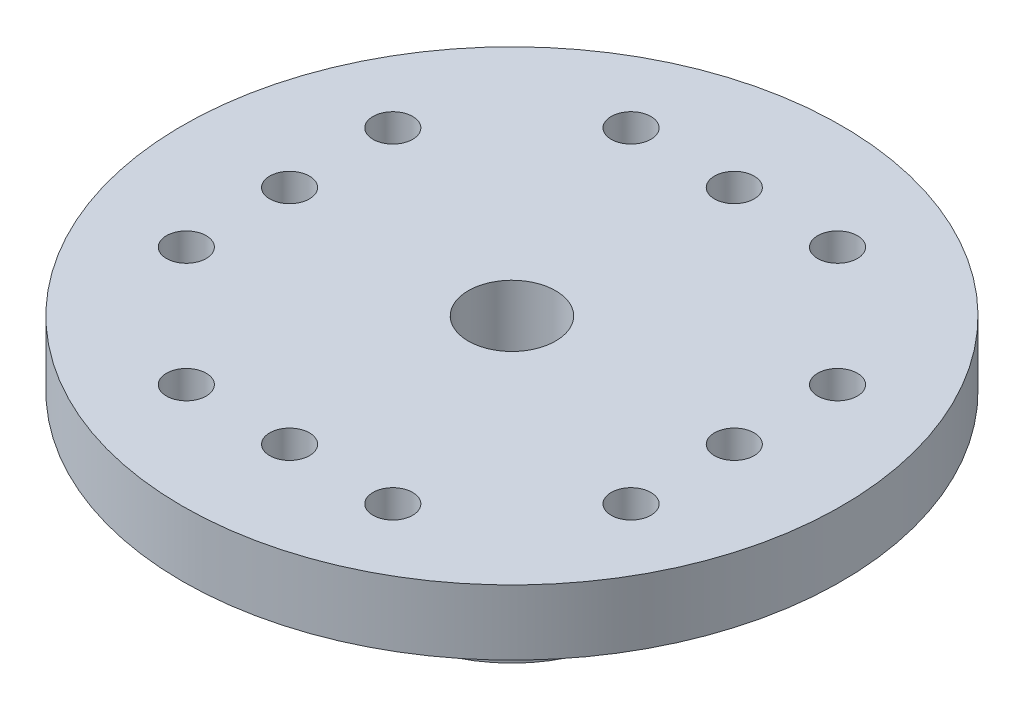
ISO-10303-21;
HEADER;
FILE_DESCRIPTION(('STEP AP214'),'2;1');
FILE_NAME('part.step','',(''),(''),'','','');
FILE_SCHEMA(('AUTOMOTIVE_DESIGN { 1 0 10303 214 1 1 1 1 }'));
ENDSEC;
DATA;
#1=APPLICATION_CONTEXT('core data for automotive mechanical design processes');
#2=APPLICATION_PROTOCOL_DEFINITION('international standard','automotive_design',2000,#1);
#3=PRODUCT_CONTEXT('',#1,'mechanical');
#4=PRODUCT('Part','Part','',(#3));
#5=PRODUCT_RELATED_PRODUCT_CATEGORY('part','',(#4));
#6=PRODUCT_DEFINITION_FORMATION('','',#4);
#7=PRODUCT_DEFINITION_CONTEXT('part definition',#1,'design');
#8=PRODUCT_DEFINITION('design','',#6,#7);
#9=PRODUCT_DEFINITION_SHAPE('','',#8);
#10=(LENGTH_UNIT() NAMED_UNIT(*) SI_UNIT(.MILLI.,.METRE.));
#11=(NAMED_UNIT(*) PLANE_ANGLE_UNIT() SI_UNIT($,.RADIAN.));
#12=(NAMED_UNIT(*) SI_UNIT($,.STERADIAN.) SOLID_ANGLE_UNIT());
#13=UNCERTAINTY_MEASURE_WITH_UNIT(LENGTH_MEASURE(1.E-05),#10,'distance_accuracy_value','');
#14=(GEOMETRIC_REPRESENTATION_CONTEXT(3) GLOBAL_UNCERTAINTY_ASSIGNED_CONTEXT((#13)) GLOBAL_UNIT_ASSIGNED_CONTEXT((#10,
#11,#12)) REPRESENTATION_CONTEXT('',''));
#15=CARTESIAN_POINT('',(0.,0.,0.));
#16=DIRECTION('',(0.,0.,1.));
#17=DIRECTION('',(1.,0.,0.));
#18=AXIS2_PLACEMENT_3D('',#15,#16,#17);
#19=CARTESIAN_POINT('',(0.,0.,0.));
#20=DIRECTION('',(0.,1.,0.));
#21=DIRECTION('',(0.,0.,1.));
#22=AXIS2_PLACEMENT_3D('',#19,#20,#21);
#23=PLANE('',#22);
#24=CARTESIAN_POINT('',(0.,0.,0.));
#25=DIRECTION('',(0.,1.,0.));
#26=DIRECTION('',(0.,0.,1.));
#27=AXIS2_PLACEMENT_3D('',#24,#25,#26);
#28=CIRCLE('',#27,3.8354);
#29=CARTESIAN_POINT('',(0.,0.,3.8354));
#30=VERTEX_POINT('',#29);
#31=EDGE_CURVE('E35',#30,#30,#28,.T.);
#32=ORIENTED_EDGE('',*,*,#31,.F.);
#33=EDGE_LOOP('',(#32));
#34=FACE_BOUND('',#33,.T.);
#35=CARTESIAN_POINT('',(0.,0.,0.));
#36=DIRECTION('',(0.,1.,0.));
#37=DIRECTION('',(0.,0.,1.));
#38=AXIS2_PLACEMENT_3D('',#35,#36,#37);
#39=CIRCLE('',#38,3.048);
#40=CARTESIAN_POINT('',(0.,0.,3.048));
#41=VERTEX_POINT('',#40);
#42=EDGE_CURVE('E42',#41,#41,#39,.T.);
#43=ORIENTED_EDGE('',*,*,#42,.T.);
#44=EDGE_LOOP('',(#43));
#45=FACE_BOUND('',#44,.T.);
#46=ADVANCED_FACE('F31',(#34,#45),#23,.F.);
#47=CARTESIAN_POINT('',(0.,4.826,0.));
#48=DIRECTION('',(0.,-1.,0.));
#49=DIRECTION('',(0.,0.,-1.));
#50=AXIS2_PLACEMENT_3D('',#47,#48,#49);
#51=CYLINDRICAL_SURFACE('',#50,3.8354);
#52=CARTESIAN_POINT('',(0.,4.826,0.));
#53=DIRECTION('',(0.,1.,0.));
#54=DIRECTION('',(0.,0.,1.));
#55=AXIS2_PLACEMENT_3D('',#52,#53,#54);
#56=CIRCLE('',#55,3.8354);
#57=CARTESIAN_POINT('',(0.,4.826,3.8354));
#58=VERTEX_POINT('',#57);
#59=EDGE_CURVE('E10',#58,#58,#56,.T.);
#60=ORIENTED_EDGE('',*,*,#59,.F.);
#61=EDGE_LOOP('',(#60));
#62=FACE_BOUND('',#61,.T.);
#63=ORIENTED_EDGE('',*,*,#31,.T.);
#64=EDGE_LOOP('',(#63));
#65=FACE_BOUND('',#64,.T.);
#66=ADVANCED_FACE('F33',(#62,#65),#51,.T.);
#67=CARTESIAN_POINT('',(0.,4.826,0.));
#68=DIRECTION('',(0.,-1.,0.));
#69=DIRECTION('',(0.,0.,-1.));
#70=AXIS2_PLACEMENT_3D('',#67,#68,#69);
#71=CYLINDRICAL_SURFACE('',#70,3.048);
#72=CARTESIAN_POINT('',(0.,4.826,0.));
#73=DIRECTION('',(0.,1.,0.));
#74=DIRECTION('',(0.,0.,1.));
#75=AXIS2_PLACEMENT_3D('',#72,#73,#74);
#76=CIRCLE('',#75,3.048);
#77=CARTESIAN_POINT('',(0.,4.826,3.048));
#78=VERTEX_POINT('',#77);
#79=EDGE_CURVE('E46',#78,#78,#76,.T.);
#80=ORIENTED_EDGE('',*,*,#79,.T.);
#81=EDGE_LOOP('',(#80));
#82=FACE_BOUND('',#81,.T.);
#83=ORIENTED_EDGE('',*,*,#42,.F.);
#84=EDGE_LOOP('',(#83));
#85=FACE_BOUND('',#84,.T.);
#86=ADVANCED_FACE('F187',(#82,#85),#71,.F.);
#87=CARTESIAN_POINT('',(0.,4.826,0.));
#88=DIRECTION('',(0.,1.,0.));
#89=DIRECTION('',(0.,0.,1.));
#90=AXIS2_PLACEMENT_3D('',#87,#88,#89);
#91=PLANE('',#90);
#92=CARTESIAN_POINT('',(0.,4.826,0.));
#93=DIRECTION('',(0.,1.,0.));
#94=DIRECTION('',(0.,0.,1.));
#95=AXIS2_PLACEMENT_3D('',#92,#93,#94);
#96=CIRCLE('',#95,1.397);
#97=CARTESIAN_POINT('',(0.,4.826,1.397));
#98=VERTEX_POINT('',#97);
#99=EDGE_CURVE('E53',#98,#98,#96,.T.);
#100=ORIENTED_EDGE('',*,*,#99,.T.);
#101=EDGE_LOOP('',(#100));
#102=FACE_BOUND('',#101,.T.);
#103=ORIENTED_EDGE('',*,*,#79,.F.);
#104=EDGE_LOOP('',(#103));
#105=FACE_BOUND('',#104,.T.);
#106=ADVANCED_FACE('F182',(#102,#105),#91,.F.);
#107=CARTESIAN_POINT('',(-1.95156391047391E-13,4.826,7.11199999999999));
#108=DIRECTION('',(0.,1.,0.));
#109=DIRECTION('',(0.,0.,1.));
#110=AXIS2_PLACEMENT_3D('',#107,#108,#109);
#111=CIRCLE('',#110,0.635000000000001);
#112=CARTESIAN_POINT('',(-1.95156391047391E-13,4.826,7.747));
#113=VERTEX_POINT('',#112);
#114=EDGE_CURVE('E125',#113,#113,#111,.T.);
#115=ORIENTED_EDGE('',*,*,#114,.T.);
#116=EDGE_LOOP('',(#115));
#117=FACE_BOUND('',#116,.T.);
#118=CARTESIAN_POINT('',(-3.30200000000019,4.826,7.11199999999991));
#119=DIRECTION('',(0.,1.,0.));
#120=DIRECTION('',(0.,0.,1.));
#121=AXIS2_PLACEMENT_3D('',#118,#119,#120);
#122=CIRCLE('',#121,0.635000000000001);
#123=CARTESIAN_POINT('',(-3.30200000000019,4.826,7.74699999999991));
#124=VERTEX_POINT('',#123);
#125=EDGE_CURVE('E119',#124,#124,#122,.T.);
#126=ORIENTED_EDGE('',*,*,#125,.T.);
#127=EDGE_LOOP('',(#126));
#128=FACE_BOUND('',#127,.T.);
#129=CARTESIAN_POINT('',(3.30199999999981,4.826,7.11200000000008));
#130=DIRECTION('',(0.,1.,0.));
#131=DIRECTION('',(0.,0.,1.));
#132=AXIS2_PLACEMENT_3D('',#129,#130,#131);
#133=CIRCLE('',#132,0.635000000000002);
#134=CARTESIAN_POINT('',(3.30199999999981,4.826,7.74700000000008));
#135=VERTEX_POINT('',#134);
#136=EDGE_CURVE('E113',#135,#135,#133,.T.);
#137=ORIENTED_EDGE('',*,*,#136,.T.);
#138=EDGE_LOOP('',(#137));
#139=FACE_BOUND('',#138,.T.);
#140=CARTESIAN_POINT('',(-3.30200000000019,4.826,-7.11199999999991));
#141=DIRECTION('',(0.,1.,0.));
#142=DIRECTION('',(0.,0.,-1.));
#143=AXIS2_PLACEMENT_3D('',#140,#141,#142);
#144=CIRCLE('',#143,0.635000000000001);
#145=CARTESIAN_POINT('',(-3.30200000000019,4.826,-7.74699999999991));
#146=VERTEX_POINT('',#145);
#147=EDGE_CURVE('E107',#146,#146,#144,.T.);
#148=ORIENTED_EDGE('',*,*,#147,.T.);
#149=EDGE_LOOP('',(#148));
#150=FACE_BOUND('',#149,.T.);
#151=CARTESIAN_POINT('',(-1.88217497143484E-13,4.826,-7.11199999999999));
#152=DIRECTION('',(0.,1.,0.));
#153=DIRECTION('',(0.,0.,-1.));
#154=AXIS2_PLACEMENT_3D('',#151,#152,#153);
#155=CIRCLE('',#154,0.635000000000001);
#156=CARTESIAN_POINT('',(-1.88217497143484E-13,4.826,-7.747));
#157=VERTEX_POINT('',#156);
#158=EDGE_CURVE('E101',#157,#157,#155,.T.);
#159=ORIENTED_EDGE('',*,*,#158,.T.);
#160=EDGE_LOOP('',(#159));
#161=FACE_BOUND('',#160,.T.);
#162=CARTESIAN_POINT('',(3.30199999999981,4.826,-7.11200000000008));
#163=DIRECTION('',(0.,1.,0.));
#164=DIRECTION('',(0.,0.,-1.));
#165=AXIS2_PLACEMENT_3D('',#162,#163,#164);
#166=CIRCLE('',#165,0.635000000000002);
#167=CARTESIAN_POINT('',(3.30199999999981,4.826,-7.74700000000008));
#168=VERTEX_POINT('',#167);
#169=EDGE_CURVE('E95',#168,#168,#166,.T.);
#170=ORIENTED_EDGE('',*,*,#169,.T.);
#171=EDGE_LOOP('',(#170));
#172=FACE_BOUND('',#171,.T.);
#173=CARTESIAN_POINT('',(7.112,4.826,-3.302));
#174=DIRECTION('',(0.,1.,0.));
#175=DIRECTION('',(0.,0.,-1.));
#176=AXIS2_PLACEMENT_3D('',#173,#174,#175);
#177=CIRCLE('',#176,0.635000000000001);
#178=CARTESIAN_POINT('',(7.112,4.826,-3.937));
#179=VERTEX_POINT('',#178);
#180=EDGE_CURVE('E89',#179,#179,#177,.T.);
#181=ORIENTED_EDGE('',*,*,#180,.T.);
#182=EDGE_LOOP('',(#181));
#183=FACE_BOUND('',#182,.T.);
#184=CARTESIAN_POINT('',(7.112,4.826,0.));
#185=DIRECTION('',(0.,1.,0.));
#186=DIRECTION('',(0.,0.,-1.));
#187=AXIS2_PLACEMENT_3D('',#184,#185,#186);
#188=CIRCLE('',#187,0.635000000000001);
#189=CARTESIAN_POINT('',(7.112,4.826,-0.635000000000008));
#190=VERTEX_POINT('',#189);
#191=EDGE_CURVE('E83',#190,#190,#188,.T.);
#192=ORIENTED_EDGE('',*,*,#191,.T.);
#193=EDGE_LOOP('',(#192));
#194=FACE_BOUND('',#193,.T.);
#195=CARTESIAN_POINT('',(7.112,4.826,3.30199999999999));
#196=DIRECTION('',(0.,1.,0.));
#197=DIRECTION('',(0.,0.,-1.));
#198=AXIS2_PLACEMENT_3D('',#195,#196,#197);
#199=CIRCLE('',#198,0.635000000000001);
#200=CARTESIAN_POINT('',(7.112,4.826,2.66699999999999));
#201=VERTEX_POINT('',#200);
#202=EDGE_CURVE('E77',#201,#201,#199,.T.);
#203=ORIENTED_EDGE('',*,*,#202,.T.);
#204=EDGE_LOOP('',(#203));
#205=FACE_BOUND('',#204,.T.);
#206=CARTESIAN_POINT('',(-7.112,4.826,3.302));
#207=DIRECTION('',(0.,1.,0.));
#208=DIRECTION('',(0.,0.,1.));
#209=AXIS2_PLACEMENT_3D('',#206,#207,#208);
#210=CIRCLE('',#209,0.635000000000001);
#211=CARTESIAN_POINT('',(-7.112,4.826,3.937));
#212=VERTEX_POINT('',#211);
#213=EDGE_CURVE('E71',#212,#212,#210,.T.);
#214=ORIENTED_EDGE('',*,*,#213,.T.);
#215=EDGE_LOOP('',(#214));
#216=FACE_BOUND('',#215,.T.);
#217=CARTESIAN_POINT('',(-7.112,4.826,-3.302));
#218=DIRECTION('',(0.,1.,0.));
#219=DIRECTION('',(0.,0.,1.));
#220=AXIS2_PLACEMENT_3D('',#217,#218,#219);
#221=CIRCLE('',#220,0.635000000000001);
#222=CARTESIAN_POINT('',(-7.112,4.826,-2.667));
#223=VERTEX_POINT('',#222);
#224=EDGE_CURVE('E65',#223,#223,#221,.T.);
#225=ORIENTED_EDGE('',*,*,#224,.T.);
#226=EDGE_LOOP('',(#225));
#227=FACE_BOUND('',#226,.T.);
#228=CARTESIAN_POINT('',(-7.112,4.826,0.));
#229=DIRECTION('',(0.,1.,0.));
#230=DIRECTION('',(0.,0.,1.));
#231=AXIS2_PLACEMENT_3D('',#228,#229,#230);
#232=CIRCLE('',#231,0.635000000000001);
#233=CARTESIAN_POINT('',(-7.112,4.826,0.635000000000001));
#234=VERTEX_POINT('',#233);
#235=EDGE_CURVE('E61',#234,#234,#232,.T.);
#236=ORIENTED_EDGE('',*,*,#235,.T.);
#237=EDGE_LOOP('',(#236));
#238=FACE_BOUND('',#237,.T.);
#239=CARTESIAN_POINT('',(0.,4.826,0.));
#240=DIRECTION('',(0.,1.,0.));
#241=DIRECTION('',(0.,0.,1.));
#242=AXIS2_PLACEMENT_3D('',#239,#240,#241);
#243=CIRCLE('',#242,10.541);
#244=CARTESIAN_POINT('',(0.,4.826,10.541));
#245=VERTEX_POINT('',#244);
#246=EDGE_CURVE('E50',#245,#245,#243,.T.);
#247=ORIENTED_EDGE('',*,*,#246,.F.);
#248=EDGE_LOOP('',(#247));
#249=FACE_BOUND('',#248,.T.);
#250=ORIENTED_EDGE('',*,*,#59,.T.);
#251=EDGE_LOOP('',(#250));
#252=FACE_BOUND('',#251,.T.);
#253=ADVANCED_FACE('F134',(#117,#128,#139,#150,#161,#172,#183,#194,#205,#216,#227,#238,#249,
#252),#91,.F.);
#254=CARTESIAN_POINT('',(0.,6.9088,0.));
#255=DIRECTION('',(0.,-1.,0.));
#256=DIRECTION('',(0.,0.,-1.));
#257=AXIS2_PLACEMENT_3D('',#254,#255,#256);
#258=CYLINDRICAL_SURFACE('',#257,10.541);
#259=CARTESIAN_POINT('',(0.,6.9088,0.));
#260=DIRECTION('',(0.,1.,0.));
#261=DIRECTION('',(0.,0.,1.));
#262=AXIS2_PLACEMENT_3D('',#259,#260,#261);
#263=CIRCLE('',#262,10.541);
#264=CARTESIAN_POINT('',(0.,6.9088,10.541));
#265=VERTEX_POINT('',#264);
#266=EDGE_CURVE('E49',#265,#265,#263,.T.);
#267=ORIENTED_EDGE('',*,*,#266,.F.);
#268=EDGE_LOOP('',(#267));
#269=FACE_BOUND('',#268,.T.);
#270=ORIENTED_EDGE('',*,*,#246,.T.);
#271=EDGE_LOOP('',(#270));
#272=FACE_BOUND('',#271,.T.);
#273=ADVANCED_FACE('F148',(#269,#272),#258,.T.);
#274=CARTESIAN_POINT('',(0.,6.9088,0.));
#275=DIRECTION('',(0.,1.,0.));
#276=DIRECTION('',(0.,0.,1.));
#277=AXIS2_PLACEMENT_3D('',#274,#275,#276);
#278=PLANE('',#277);
#279=CARTESIAN_POINT('',(-1.95156391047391E-13,6.9088,7.11199999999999));
#280=DIRECTION('',(0.,1.,0.));
#281=DIRECTION('',(0.,0.,1.));
#282=AXIS2_PLACEMENT_3D('',#279,#280,#281);
#283=CIRCLE('',#282,0.635000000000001);
#284=CARTESIAN_POINT('',(-1.95156391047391E-13,6.9088,7.747));
#285=VERTEX_POINT('',#284);
#286=EDGE_CURVE('E128',#285,#285,#283,.T.);
#287=ORIENTED_EDGE('',*,*,#286,.F.);
#288=EDGE_LOOP('',(#287));
#289=FACE_BOUND('',#288,.T.);
#290=CARTESIAN_POINT('',(-3.30200000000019,6.9088,7.11199999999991));
#291=DIRECTION('',(0.,1.,0.));
#292=DIRECTION('',(0.,0.,1.));
#293=AXIS2_PLACEMENT_3D('',#290,#291,#292);
#294=CIRCLE('',#293,0.635000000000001);
#295=CARTESIAN_POINT('',(-3.30200000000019,6.9088,7.74699999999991));
#296=VERTEX_POINT('',#295);
#297=EDGE_CURVE('E122',#296,#296,#294,.T.);
#298=ORIENTED_EDGE('',*,*,#297,.F.);
#299=EDGE_LOOP('',(#298));
#300=FACE_BOUND('',#299,.T.);
#301=CARTESIAN_POINT('',(3.30199999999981,6.9088,7.11200000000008));
#302=DIRECTION('',(0.,1.,0.));
#303=DIRECTION('',(0.,0.,1.));
#304=AXIS2_PLACEMENT_3D('',#301,#302,#303);
#305=CIRCLE('',#304,0.635000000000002);
#306=CARTESIAN_POINT('',(3.30199999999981,6.9088,7.74700000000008));
#307=VERTEX_POINT('',#306);
#308=EDGE_CURVE('E116',#307,#307,#305,.T.);
#309=ORIENTED_EDGE('',*,*,#308,.F.);
#310=EDGE_LOOP('',(#309));
#311=FACE_BOUND('',#310,.T.);
#312=CARTESIAN_POINT('',(-3.30200000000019,6.9088,-7.11199999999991));
#313=DIRECTION('',(0.,1.,0.));
#314=DIRECTION('',(0.,0.,-1.));
#315=AXIS2_PLACEMENT_3D('',#312,#313,#314);
#316=CIRCLE('',#315,0.635000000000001);
#317=CARTESIAN_POINT('',(-3.30200000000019,6.9088,-7.74699999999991));
#318=VERTEX_POINT('',#317);
#319=EDGE_CURVE('E110',#318,#318,#316,.T.);
#320=ORIENTED_EDGE('',*,*,#319,.F.);
#321=EDGE_LOOP('',(#320));
#322=FACE_BOUND('',#321,.T.);
#323=CARTESIAN_POINT('',(-1.88217497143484E-13,6.9088,-7.11199999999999));
#324=DIRECTION('',(0.,1.,0.));
#325=DIRECTION('',(0.,0.,-1.));
#326=AXIS2_PLACEMENT_3D('',#323,#324,#325);
#327=CIRCLE('',#326,0.635000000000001);
#328=CARTESIAN_POINT('',(-1.88217497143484E-13,6.9088,-7.747));
#329=VERTEX_POINT('',#328);
#330=EDGE_CURVE('E104',#329,#329,#327,.T.);
#331=ORIENTED_EDGE('',*,*,#330,.F.);
#332=EDGE_LOOP('',(#331));
#333=FACE_BOUND('',#332,.T.);
#334=CARTESIAN_POINT('',(3.30199999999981,6.9088,-7.11200000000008));
#335=DIRECTION('',(0.,1.,0.));
#336=DIRECTION('',(0.,0.,-1.));
#337=AXIS2_PLACEMENT_3D('',#334,#335,#336);
#338=CIRCLE('',#337,0.635000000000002);
#339=CARTESIAN_POINT('',(3.30199999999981,6.9088,-7.74700000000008));
#340=VERTEX_POINT('',#339);
#341=EDGE_CURVE('E98',#340,#340,#338,.T.);
#342=ORIENTED_EDGE('',*,*,#341,.F.);
#343=EDGE_LOOP('',(#342));
#344=FACE_BOUND('',#343,.T.);
#345=CARTESIAN_POINT('',(7.112,6.9088,-3.302));
#346=DIRECTION('',(0.,1.,0.));
#347=DIRECTION('',(0.,0.,-1.));
#348=AXIS2_PLACEMENT_3D('',#345,#346,#347);
#349=CIRCLE('',#348,0.635000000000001);
#350=CARTESIAN_POINT('',(7.112,6.9088,-3.937));
#351=VERTEX_POINT('',#350);
#352=EDGE_CURVE('E92',#351,#351,#349,.T.);
#353=ORIENTED_EDGE('',*,*,#352,.F.);
#354=EDGE_LOOP('',(#353));
#355=FACE_BOUND('',#354,.T.);
#356=CARTESIAN_POINT('',(7.112,6.9088,0.));
#357=DIRECTION('',(0.,1.,0.));
#358=DIRECTION('',(0.,0.,-1.));
#359=AXIS2_PLACEMENT_3D('',#356,#357,#358);
#360=CIRCLE('',#359,0.635000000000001);
#361=CARTESIAN_POINT('',(7.112,6.9088,-0.635000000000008));
#362=VERTEX_POINT('',#361);
#363=EDGE_CURVE('E86',#362,#362,#360,.T.);
#364=ORIENTED_EDGE('',*,*,#363,.F.);
#365=EDGE_LOOP('',(#364));
#366=FACE_BOUND('',#365,.T.);
#367=CARTESIAN_POINT('',(7.112,6.9088,3.30199999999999));
#368=DIRECTION('',(0.,1.,0.));
#369=DIRECTION('',(0.,0.,-1.));
#370=AXIS2_PLACEMENT_3D('',#367,#368,#369);
#371=CIRCLE('',#370,0.635000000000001);
#372=CARTESIAN_POINT('',(7.112,6.9088,2.66699999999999));
#373=VERTEX_POINT('',#372);
#374=EDGE_CURVE('E80',#373,#373,#371,.T.);
#375=ORIENTED_EDGE('',*,*,#374,.F.);
#376=EDGE_LOOP('',(#375));
#377=FACE_BOUND('',#376,.T.);
#378=CARTESIAN_POINT('',(-7.112,6.9088,3.302));
#379=DIRECTION('',(0.,1.,0.));
#380=DIRECTION('',(0.,0.,1.));
#381=AXIS2_PLACEMENT_3D('',#378,#379,#380);
#382=CIRCLE('',#381,0.635000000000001);
#383=CARTESIAN_POINT('',(-7.112,6.9088,3.937));
#384=VERTEX_POINT('',#383);
#385=EDGE_CURVE('E74',#384,#384,#382,.T.);
#386=ORIENTED_EDGE('',*,*,#385,.F.);
#387=EDGE_LOOP('',(#386));
#388=FACE_BOUND('',#387,.T.);
#389=CARTESIAN_POINT('',(-7.112,6.9088,-3.302));
#390=DIRECTION('',(0.,1.,0.));
#391=DIRECTION('',(0.,0.,1.));
#392=AXIS2_PLACEMENT_3D('',#389,#390,#391);
#393=CIRCLE('',#392,0.635000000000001);
#394=CARTESIAN_POINT('',(-7.112,6.9088,-2.667));
#395=VERTEX_POINT('',#394);
#396=EDGE_CURVE('E68',#395,#395,#393,.T.);
#397=ORIENTED_EDGE('',*,*,#396,.F.);
#398=EDGE_LOOP('',(#397));
#399=FACE_BOUND('',#398,.T.);
#400=CARTESIAN_POINT('',(-7.112,6.9088,0.));
#401=DIRECTION('',(0.,1.,0.));
#402=DIRECTION('',(0.,0.,1.));
#403=AXIS2_PLACEMENT_3D('',#400,#401,#402);
#404=CIRCLE('',#403,0.635000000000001);
#405=CARTESIAN_POINT('',(-7.112,6.9088,0.635000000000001));
#406=VERTEX_POINT('',#405);
#407=EDGE_CURVE('E62',#406,#406,#404,.T.);
#408=ORIENTED_EDGE('',*,*,#407,.F.);
#409=EDGE_LOOP('',(#408));
#410=FACE_BOUND('',#409,.T.);
#411=CARTESIAN_POINT('',(0.,6.9088,0.));
#412=DIRECTION('',(0.,1.,0.));
#413=DIRECTION('',(0.,0.,1.));
#414=AXIS2_PLACEMENT_3D('',#411,#412,#413);
#415=CIRCLE('',#414,1.397);
#416=CARTESIAN_POINT('',(0.,6.9088,1.397));
#417=VERTEX_POINT('',#416);
#418=EDGE_CURVE('E58',#417,#417,#415,.T.);
#419=ORIENTED_EDGE('',*,*,#418,.F.);
#420=EDGE_LOOP('',(#419));
#421=FACE_BOUND('',#420,.T.);
#422=ORIENTED_EDGE('',*,*,#266,.T.);
#423=EDGE_LOOP('',(#422));
#424=FACE_BOUND('',#423,.T.);
#425=ADVANCED_FACE('F144',(#289,#300,#311,#322,#333,#344,#355,#366,#377,#388,#399,#410,#421,
#424),#278,.T.);
#426=CARTESIAN_POINT('',(0.,0.,0.));
#427=DIRECTION('',(0.,1.,0.));
#428=DIRECTION('',(0.,0.,1.));
#429=AXIS2_PLACEMENT_3D('',#426,#427,#428);
#430=CYLINDRICAL_SURFACE('',#429,1.397);
#431=ORIENTED_EDGE('',*,*,#418,.T.);
#432=EDGE_LOOP('',(#431));
#433=FACE_BOUND('',#432,.T.);
#434=ORIENTED_EDGE('',*,*,#99,.F.);
#435=EDGE_LOOP('',(#434));
#436=FACE_BOUND('',#435,.T.);
#437=ADVANCED_FACE('F147',(#433,#436),#430,.F.);
#438=CARTESIAN_POINT('',(-7.112,4.826,0.));
#439=DIRECTION('',(0.,1.,0.));
#440=DIRECTION('',(0.,0.,1.));
#441=AXIS2_PLACEMENT_3D('',#438,#439,#440);
#442=CYLINDRICAL_SURFACE('',#441,0.635000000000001);
#443=ORIENTED_EDGE('',*,*,#235,.F.);
#444=EDGE_LOOP('',(#443));
#445=FACE_BOUND('',#444,.T.);
#446=ORIENTED_EDGE('',*,*,#407,.T.);
#447=EDGE_LOOP('',(#446));
#448=FACE_BOUND('',#447,.T.);
#449=ADVANCED_FACE('F224',(#445,#448),#442,.F.);
#450=CARTESIAN_POINT('',(-7.112,4.826,-3.302));
#451=DIRECTION('',(0.,1.,0.));
#452=DIRECTION('',(0.,0.,1.));
#453=AXIS2_PLACEMENT_3D('',#450,#451,#452);
#454=CYLINDRICAL_SURFACE('',#453,0.635000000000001);
#455=ORIENTED_EDGE('',*,*,#224,.F.);
#456=EDGE_LOOP('',(#455));
#457=FACE_BOUND('',#456,.T.);
#458=ORIENTED_EDGE('',*,*,#396,.T.);
#459=EDGE_LOOP('',(#458));
#460=FACE_BOUND('',#459,.T.);
#461=ADVANCED_FACE('F244',(#457,#460),#454,.F.);
#462=CARTESIAN_POINT('',(-7.112,4.826,3.302));
#463=DIRECTION('',(0.,1.,0.));
#464=DIRECTION('',(0.,0.,1.));
#465=AXIS2_PLACEMENT_3D('',#462,#463,#464);
#466=CYLINDRICAL_SURFACE('',#465,0.635000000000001);
#467=ORIENTED_EDGE('',*,*,#213,.F.);
#468=EDGE_LOOP('',(#467));
#469=FACE_BOUND('',#468,.T.);
#470=ORIENTED_EDGE('',*,*,#385,.T.);
#471=EDGE_LOOP('',(#470));
#472=FACE_BOUND('',#471,.T.);
#473=ADVANCED_FACE('F254',(#469,#472),#466,.F.);
#474=CARTESIAN_POINT('',(7.112,4.826,3.30199999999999));
#475=DIRECTION('',(0.,1.,0.));
#476=DIRECTION('',(0.,0.,1.));
#477=AXIS2_PLACEMENT_3D('',#474,#475,#476);
#478=CYLINDRICAL_SURFACE('',#477,0.635000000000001);
#479=ORIENTED_EDGE('',*,*,#202,.F.);
#480=EDGE_LOOP('',(#479));
#481=FACE_BOUND('',#480,.T.);
#482=ORIENTED_EDGE('',*,*,#374,.T.);
#483=EDGE_LOOP('',(#482));
#484=FACE_BOUND('',#483,.T.);
#485=ADVANCED_FACE('F264',(#481,#484),#478,.F.);
#486=CARTESIAN_POINT('',(7.112,4.826,0.));
#487=DIRECTION('',(0.,1.,0.));
#488=DIRECTION('',(0.,0.,1.));
#489=AXIS2_PLACEMENT_3D('',#486,#487,#488);
#490=CYLINDRICAL_SURFACE('',#489,0.635000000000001);
#491=ORIENTED_EDGE('',*,*,#191,.F.);
#492=EDGE_LOOP('',(#491));
#493=FACE_BOUND('',#492,.T.);
#494=ORIENTED_EDGE('',*,*,#363,.T.);
#495=EDGE_LOOP('',(#494));
#496=FACE_BOUND('',#495,.T.);
#497=ADVANCED_FACE('F274',(#493,#496),#490,.F.);
#498=CARTESIAN_POINT('',(7.112,4.826,-3.302));
#499=DIRECTION('',(0.,1.,0.));
#500=DIRECTION('',(0.,0.,1.));
#501=AXIS2_PLACEMENT_3D('',#498,#499,#500);
#502=CYLINDRICAL_SURFACE('',#501,0.635000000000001);
#503=ORIENTED_EDGE('',*,*,#180,.F.);
#504=EDGE_LOOP('',(#503));
#505=FACE_BOUND('',#504,.T.);
#506=ORIENTED_EDGE('',*,*,#352,.T.);
#507=EDGE_LOOP('',(#506));
#508=FACE_BOUND('',#507,.T.);
#509=ADVANCED_FACE('F284',(#505,#508),#502,.F.);
#510=CARTESIAN_POINT('',(3.30199999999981,4.826,-7.11200000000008));
#511=DIRECTION('',(0.,1.,0.));
#512=DIRECTION('',(0.,0.,1.));
#513=AXIS2_PLACEMENT_3D('',#510,#511,#512);
#514=CYLINDRICAL_SURFACE('',#513,0.635000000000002);
#515=ORIENTED_EDGE('',*,*,#169,.F.);
#516=EDGE_LOOP('',(#515));
#517=FACE_BOUND('',#516,.T.);
#518=ORIENTED_EDGE('',*,*,#341,.T.);
#519=EDGE_LOOP('',(#518));
#520=FACE_BOUND('',#519,.T.);
#521=ADVANCED_FACE('F294',(#517,#520),#514,.F.);
#522=CARTESIAN_POINT('',(-1.88217497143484E-13,4.826,-7.11199999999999));
#523=DIRECTION('',(0.,1.,0.));
#524=DIRECTION('',(0.,0.,1.));
#525=AXIS2_PLACEMENT_3D('',#522,#523,#524);
#526=CYLINDRICAL_SURFACE('',#525,0.635000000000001);
#527=ORIENTED_EDGE('',*,*,#158,.F.);
#528=EDGE_LOOP('',(#527));
#529=FACE_BOUND('',#528,.T.);
#530=ORIENTED_EDGE('',*,*,#330,.T.);
#531=EDGE_LOOP('',(#530));
#532=FACE_BOUND('',#531,.T.);
#533=ADVANCED_FACE('F304',(#529,#532),#526,.F.);
#534=CARTESIAN_POINT('',(-3.30200000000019,4.826,-7.11199999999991));
#535=DIRECTION('',(0.,1.,0.));
#536=DIRECTION('',(0.,0.,1.));
#537=AXIS2_PLACEMENT_3D('',#534,#535,#536);
#538=CYLINDRICAL_SURFACE('',#537,0.635000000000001);
#539=ORIENTED_EDGE('',*,*,#147,.F.);
#540=EDGE_LOOP('',(#539));
#541=FACE_BOUND('',#540,.T.);
#542=ORIENTED_EDGE('',*,*,#319,.T.);
#543=EDGE_LOOP('',(#542));
#544=FACE_BOUND('',#543,.T.);
#545=ADVANCED_FACE('F314',(#541,#544),#538,.F.);
#546=CARTESIAN_POINT('',(3.30199999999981,4.826,7.11200000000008));
#547=DIRECTION('',(0.,1.,0.));
#548=DIRECTION('',(0.,0.,1.));
#549=AXIS2_PLACEMENT_3D('',#546,#547,#548);
#550=CYLINDRICAL_SURFACE('',#549,0.635000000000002);
#551=ORIENTED_EDGE('',*,*,#136,.F.);
#552=EDGE_LOOP('',(#551));
#553=FACE_BOUND('',#552,.T.);
#554=ORIENTED_EDGE('',*,*,#308,.T.);
#555=EDGE_LOOP('',(#554));
#556=FACE_BOUND('',#555,.T.);
#557=ADVANCED_FACE('F324',(#553,#556),#550,.F.);
#558=CARTESIAN_POINT('',(-3.30200000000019,4.826,7.11199999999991));
#559=DIRECTION('',(0.,1.,0.));
#560=DIRECTION('',(0.,0.,1.));
#561=AXIS2_PLACEMENT_3D('',#558,#559,#560);
#562=CYLINDRICAL_SURFACE('',#561,0.635000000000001);
#563=ORIENTED_EDGE('',*,*,#125,.F.);
#564=EDGE_LOOP('',(#563));
#565=FACE_BOUND('',#564,.T.);
#566=ORIENTED_EDGE('',*,*,#297,.T.);
#567=EDGE_LOOP('',(#566));
#568=FACE_BOUND('',#567,.T.);
#569=ADVANCED_FACE('F140',(#565,#568),#562,.F.);
#570=CARTESIAN_POINT('',(-1.95156391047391E-13,4.826,7.11199999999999));
#571=DIRECTION('',(0.,1.,0.));
#572=DIRECTION('',(0.,0.,1.));
#573=AXIS2_PLACEMENT_3D('',#570,#571,#572);
#574=CYLINDRICAL_SURFACE('',#573,0.635000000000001);
#575=ORIENTED_EDGE('',*,*,#114,.F.);
#576=EDGE_LOOP('',(#575));
#577=FACE_BOUND('',#576,.T.);
#578=ORIENTED_EDGE('',*,*,#286,.T.);
#579=EDGE_LOOP('',(#578));
#580=FACE_BOUND('',#579,.T.);
#581=ADVANCED_FACE('F137',(#577,#580),#574,.F.);
#582=CLOSED_SHELL('',(#46,#66,#86,#106,#253,#273,#425,#437,#449,#461,#473,#485,#497,#509,#521,
#533,#545,#557,#569,#581));
#583=MANIFOLD_SOLID_BREP('B2',#582);
#584=ADVANCED_BREP_SHAPE_REPRESENTATION('',(#18,#583),#14);
#585=SHAPE_DEFINITION_REPRESENTATION(#9,#584);
ENDSEC;
END-ISO-10303-21;
